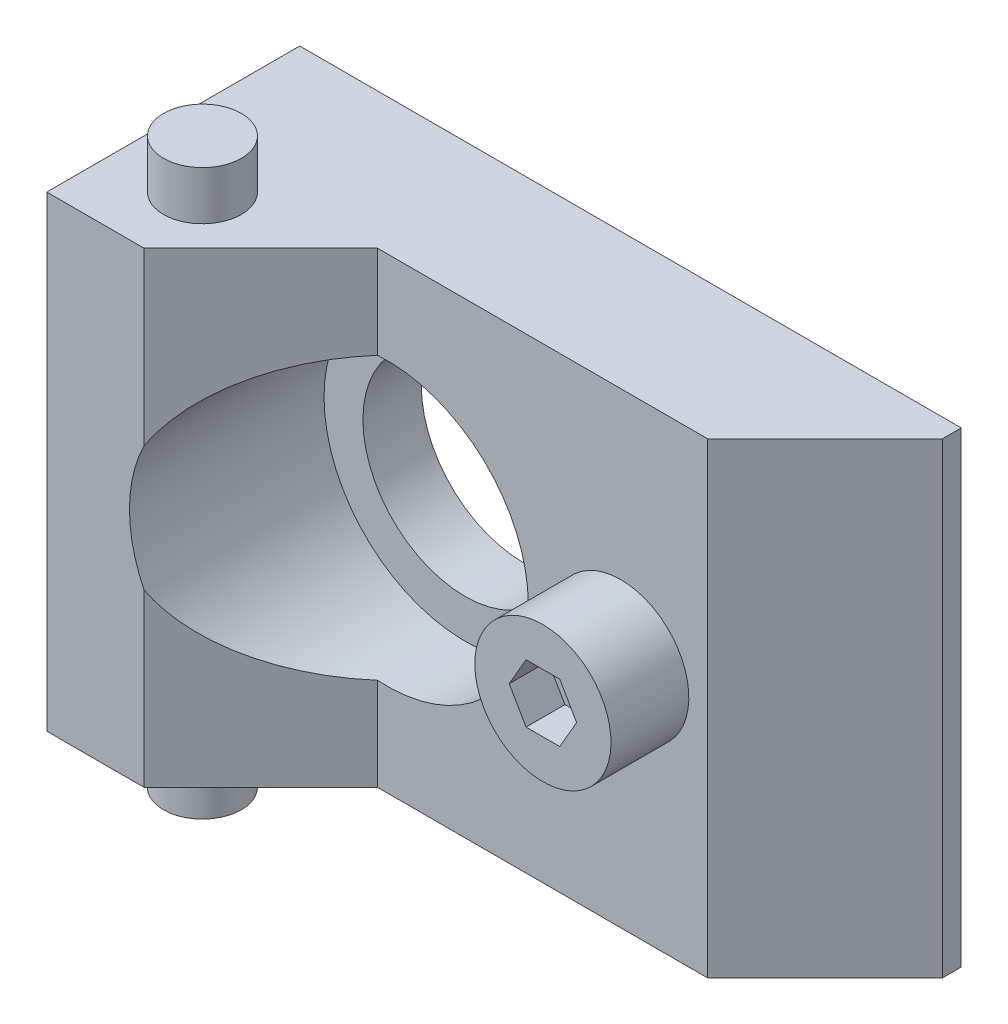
ISO-10303-21;
HEADER;
FILE_DESCRIPTION(('STEP AP214'),'2;1');
FILE_NAME('part.step','',(''),(''),'','','');
FILE_SCHEMA(('AUTOMOTIVE_DESIGN { 1 0 10303 214 1 1 1 1 }'));
ENDSEC;
DATA;
#1=APPLICATION_CONTEXT('core data for automotive mechanical design processes');
#2=APPLICATION_PROTOCOL_DEFINITION('international standard','automotive_design',2000,#1);
#3=PRODUCT_CONTEXT('',#1,'mechanical');
#4=PRODUCT('Part','Part','',(#3));
#5=PRODUCT_RELATED_PRODUCT_CATEGORY('part','',(#4));
#6=PRODUCT_DEFINITION_FORMATION('','',#4);
#7=PRODUCT_DEFINITION_CONTEXT('part definition',#1,'design');
#8=PRODUCT_DEFINITION('design','',#6,#7);
#9=PRODUCT_DEFINITION_SHAPE('','',#8);
#10=(LENGTH_UNIT() NAMED_UNIT(*) SI_UNIT(.MILLI.,.METRE.));
#11=(NAMED_UNIT(*) PLANE_ANGLE_UNIT() SI_UNIT($,.RADIAN.));
#12=(NAMED_UNIT(*) SI_UNIT($,.STERADIAN.) SOLID_ANGLE_UNIT());
#13=UNCERTAINTY_MEASURE_WITH_UNIT(LENGTH_MEASURE(1.E-05),#10,'distance_accuracy_value','');
#14=(GEOMETRIC_REPRESENTATION_CONTEXT(3) GLOBAL_UNCERTAINTY_ASSIGNED_CONTEXT((#13)) GLOBAL_UNIT_ASSIGNED_CONTEXT((#10,
#11,#12)) REPRESENTATION_CONTEXT('',''));
#15=CARTESIAN_POINT('',(0.,0.,0.));
#16=DIRECTION('',(0.,0.,1.));
#17=DIRECTION('',(1.,0.,0.));
#18=AXIS2_PLACEMENT_3D('',#15,#16,#17);
#19=CARTESIAN_POINT('',(0.,0.,-7.));
#20=DIRECTION('',(0.,0.,1.));
#21=DIRECTION('',(-0.898965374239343,-0.438019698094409,0.));
#22=AXIS2_PLACEMENT_3D('',#19,#20,#21);
#23=CYLINDRICAL_SURFACE('',#22,3.);
#24=CARTESIAN_POINT('',(0.,0.,-7.));
#25=DIRECTION('',(0.,0.,-1.));
#26=DIRECTION('',(0.898965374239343,0.438019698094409,0.));
#27=AXIS2_PLACEMENT_3D('',#24,#25,#26);
#28=CIRCLE('',#27,3.);
#29=CARTESIAN_POINT('',(2.69689612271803,1.31405909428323,-7.));
#30=VERTEX_POINT('',#29);
#31=EDGE_CURVE('E21',#30,#30,#28,.T.);
#32=ORIENTED_EDGE('',*,*,#31,.F.);
#33=EDGE_LOOP('',(#32));
#34=FACE_BOUND('',#33,.T.);
#35=CARTESIAN_POINT('',(0.,0.,0.));
#36=DIRECTION('',(0.,0.,1.));
#37=DIRECTION('',(0.,-1.,0.));
#38=AXIS2_PLACEMENT_3D('',#35,#36,#37);
#39=CIRCLE('',#38,3.);
#40=CARTESIAN_POINT('',(0.,-3.,0.));
#41=VERTEX_POINT('',#40);
#42=EDGE_CURVE('E9',#41,#41,#39,.T.);
#43=ORIENTED_EDGE('',*,*,#42,.F.);
#44=EDGE_LOOP('',(#43));
#45=FACE_BOUND('',#44,.T.);
#46=ADVANCED_FACE('F14',(#34,#45),#23,.T.);
#47=CARTESIAN_POINT('',(0.,0.,-7.));
#48=DIRECTION('',(0.,0.,-1.));
#49=DIRECTION('',(0.898965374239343,0.438019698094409,0.));
#50=AXIS2_PLACEMENT_3D('',#47,#48,#49);
#51=PLANE('',#50);
#52=ORIENTED_EDGE('',*,*,#31,.T.);
#53=EDGE_LOOP('',(#52));
#54=FACE_BOUND('',#53,.T.);
#55=ADVANCED_FACE('F224',(#54),#51,.T.);
#56=CARTESIAN_POINT('',(-0.866025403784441,1.5,9.));
#57=DIRECTION('',(0.,0.,1.));
#58=DIRECTION('',(0.,1.,0.));
#59=AXIS2_PLACEMENT_3D('',#56,#57,#58);
#60=PLANE('',#59);
#61=DIRECTION('',(0.5,0.86602540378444,0.));
#62=VECTOR('',#61,1.);
#63=CARTESIAN_POINT('',(-1.73205080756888,0.,9.));
#64=LINE('',#63,#62);
#65=CARTESIAN_POINT('',(-1.73205080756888,0.,9.));
#66=VERTEX_POINT('',#65);
#67=CARTESIAN_POINT('',(-0.866025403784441,1.5,9.));
#68=VERTEX_POINT('',#67);
#69=EDGE_CURVE('E175',#66,#68,#64,.T.);
#70=ORIENTED_EDGE('',*,*,#69,.F.);
#71=DIRECTION('',(0.5,-0.86602540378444,0.));
#72=VECTOR('',#71,1.);
#73=CARTESIAN_POINT('',(-1.73205080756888,0.,9.));
#74=LINE('',#73,#72);
#75=CARTESIAN_POINT('',(-0.866025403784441,-1.5,9.));
#76=VERTEX_POINT('',#75);
#77=EDGE_CURVE('E189',#66,#76,#74,.T.);
#78=ORIENTED_EDGE('',*,*,#77,.T.);
#79=DIRECTION('',(1.,0.,0.));
#80=VECTOR('',#79,1.);
#81=CARTESIAN_POINT('',(-0.866025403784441,-1.5,9.));
#82=LINE('',#81,#80);
#83=CARTESIAN_POINT('',(0.866025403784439,-1.5,9.));
#84=VERTEX_POINT('',#83);
#85=EDGE_CURVE('E192',#76,#84,#82,.T.);
#86=ORIENTED_EDGE('',*,*,#85,.T.);
#87=DIRECTION('',(-0.5,-0.86602540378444,0.));
#88=VECTOR('',#87,1.);
#89=CARTESIAN_POINT('',(1.73205080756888,0.,9.));
#90=LINE('',#89,#88);
#91=CARTESIAN_POINT('',(1.73205080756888,0.,9.));
#92=VERTEX_POINT('',#91);
#93=EDGE_CURVE('E195',#92,#84,#90,.T.);
#94=ORIENTED_EDGE('',*,*,#93,.F.);
#95=DIRECTION('',(-0.5,0.86602540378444,0.));
#96=VECTOR('',#95,1.);
#97=CARTESIAN_POINT('',(1.73205080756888,0.,9.));
#98=LINE('',#97,#96);
#99=CARTESIAN_POINT('',(0.866025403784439,1.5,9.));
#100=VERTEX_POINT('',#99);
#101=EDGE_CURVE('E198',#92,#100,#98,.T.);
#102=ORIENTED_EDGE('',*,*,#101,.T.);
#103=DIRECTION('',(-1.,0.,0.));
#104=VECTOR('',#103,1.);
#105=CARTESIAN_POINT('',(0.866025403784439,1.5,9.));
#106=LINE('',#105,#104);
#107=EDGE_CURVE('E201',#100,#68,#106,.T.);
#108=ORIENTED_EDGE('',*,*,#107,.T.);
#109=EDGE_LOOP('',(#70,#78,#86,#94,#102,#108));
#110=FACE_BOUND('',#109,.T.);
#111=ADVANCED_FACE('F244',(#110),#60,.T.);
#112=CARTESIAN_POINT('',(-0.866025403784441,-1.5,9.));
#113=DIRECTION('',(0.,-1.,0.));
#114=DIRECTION('',(1.,0.,0.));
#115=AXIS2_PLACEMENT_3D('',#112,#113,#114);
#116=PLANE('',#115);
#117=DIRECTION('',(0.,0.,1.));
#118=VECTOR('',#117,1.);
#119=CARTESIAN_POINT('',(-0.866025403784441,-1.5,9.));
#120=LINE('',#119,#118);
#121=CARTESIAN_POINT('',(-0.866025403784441,-1.5,11.));
#122=VERTEX_POINT('',#121);
#123=EDGE_CURVE('E206',#76,#122,#120,.T.);
#124=ORIENTED_EDGE('',*,*,#123,.T.);
#125=DIRECTION('',(1.,0.,0.));
#126=VECTOR('',#125,1.);
#127=CARTESIAN_POINT('',(-0.866025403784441,-1.5,11.));
#128=LINE('',#127,#126);
#129=CARTESIAN_POINT('',(0.866025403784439,-1.5,11.));
#130=VERTEX_POINT('',#129);
#131=EDGE_CURVE('E176',#122,#130,#128,.T.);
#132=ORIENTED_EDGE('',*,*,#131,.T.);
#133=DIRECTION('',(0.,0.,1.));
#134=VECTOR('',#133,1.);
#135=CARTESIAN_POINT('',(0.866025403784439,-1.5,9.));
#136=LINE('',#135,#134);
#137=EDGE_CURVE('E208',#84,#130,#136,.T.);
#138=ORIENTED_EDGE('',*,*,#137,.F.);
#139=ORIENTED_EDGE('',*,*,#85,.F.);
#140=EDGE_LOOP('',(#124,#132,#138,#139));
#141=FACE_BOUND('',#140,.T.);
#142=ADVANCED_FACE('F246',(#141),#116,.F.);
#143=CARTESIAN_POINT('',(1.73205080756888,0.,9.));
#144=DIRECTION('',(-0.86602540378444,0.5,0.));
#145=DIRECTION('',(-0.5,-0.86602540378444,0.));
#146=AXIS2_PLACEMENT_3D('',#143,#144,#145);
#147=PLANE('',#146);
#148=ORIENTED_EDGE('',*,*,#137,.T.);
#149=DIRECTION('',(-0.5,-0.86602540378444,0.));
#150=VECTOR('',#149,1.);
#151=CARTESIAN_POINT('',(1.73205080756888,0.,11.));
#152=LINE('',#151,#150);
#153=CARTESIAN_POINT('',(1.73205080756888,0.,11.));
#154=VERTEX_POINT('',#153);
#155=EDGE_CURVE('E179',#154,#130,#152,.T.);
#156=ORIENTED_EDGE('',*,*,#155,.F.);
#157=DIRECTION('',(0.,0.,1.));
#158=VECTOR('',#157,1.);
#159=CARTESIAN_POINT('',(1.73205080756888,0.,9.));
#160=LINE('',#159,#158);
#161=EDGE_CURVE('E210',#92,#154,#160,.T.);
#162=ORIENTED_EDGE('',*,*,#161,.F.);
#163=ORIENTED_EDGE('',*,*,#93,.T.);
#164=EDGE_LOOP('',(#148,#156,#162,#163));
#165=FACE_BOUND('',#164,.T.);
#166=ADVANCED_FACE('F254',(#165),#147,.T.);
#167=CARTESIAN_POINT('',(1.73205080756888,0.,9.));
#168=DIRECTION('',(0.86602540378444,0.5,0.));
#169=DIRECTION('',(-0.5,0.86602540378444,0.));
#170=AXIS2_PLACEMENT_3D('',#167,#168,#169);
#171=PLANE('',#170);
#172=ORIENTED_EDGE('',*,*,#161,.T.);
#173=DIRECTION('',(-0.5,0.86602540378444,0.));
#174=VECTOR('',#173,1.);
#175=CARTESIAN_POINT('',(1.73205080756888,0.,11.));
#176=LINE('',#175,#174);
#177=CARTESIAN_POINT('',(0.866025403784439,1.5,11.));
#178=VERTEX_POINT('',#177);
#179=EDGE_CURVE('E182',#154,#178,#176,.T.);
#180=ORIENTED_EDGE('',*,*,#179,.T.);
#181=DIRECTION('',(0.,0.,1.));
#182=VECTOR('',#181,1.);
#183=CARTESIAN_POINT('',(0.866025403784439,1.5,9.));
#184=LINE('',#183,#182);
#185=EDGE_CURVE('E212',#100,#178,#184,.T.);
#186=ORIENTED_EDGE('',*,*,#185,.F.);
#187=ORIENTED_EDGE('',*,*,#101,.F.);
#188=EDGE_LOOP('',(#172,#180,#186,#187));
#189=FACE_BOUND('',#188,.T.);
#190=ADVANCED_FACE('F270',(#189),#171,.F.);
#191=CARTESIAN_POINT('',(0.866025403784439,1.5,9.));
#192=DIRECTION('',(0.,1.,0.));
#193=DIRECTION('',(-1.,0.,0.));
#194=AXIS2_PLACEMENT_3D('',#191,#192,#193);
#195=PLANE('',#194);
#196=ORIENTED_EDGE('',*,*,#185,.T.);
#197=DIRECTION('',(-1.,0.,0.));
#198=VECTOR('',#197,1.);
#199=CARTESIAN_POINT('',(0.866025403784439,1.5,11.));
#200=LINE('',#199,#198);
#201=CARTESIAN_POINT('',(-0.866025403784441,1.5,11.));
#202=VERTEX_POINT('',#201);
#203=EDGE_CURVE('E185',#178,#202,#200,.T.);
#204=ORIENTED_EDGE('',*,*,#203,.T.);
#205=DIRECTION('',(0.,0.,1.));
#206=VECTOR('',#205,1.);
#207=CARTESIAN_POINT('',(-0.866025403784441,1.5,9.));
#208=LINE('',#207,#206);
#209=EDGE_CURVE('E214',#68,#202,#208,.T.);
#210=ORIENTED_EDGE('',*,*,#209,.F.);
#211=ORIENTED_EDGE('',*,*,#107,.F.);
#212=EDGE_LOOP('',(#196,#204,#210,#211));
#213=FACE_BOUND('',#212,.T.);
#214=ADVANCED_FACE('F263',(#213),#195,.F.);
#215=CARTESIAN_POINT('',(-1.73205080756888,0.,9.));
#216=DIRECTION('',(0.86602540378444,-0.5,0.));
#217=DIRECTION('',(0.5,0.86602540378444,0.));
#218=AXIS2_PLACEMENT_3D('',#215,#216,#217);
#219=PLANE('',#218);
#220=ORIENTED_EDGE('',*,*,#209,.T.);
#221=DIRECTION('',(0.5,0.86602540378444,0.));
#222=VECTOR('',#221,1.);
#223=CARTESIAN_POINT('',(-1.73205080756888,0.,11.));
#224=LINE('',#223,#222);
#225=CARTESIAN_POINT('',(-1.73205080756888,0.,11.));
#226=VERTEX_POINT('',#225);
#227=EDGE_CURVE('E28',#226,#202,#224,.T.);
#228=ORIENTED_EDGE('',*,*,#227,.F.);
#229=DIRECTION('',(0.,0.,1.));
#230=VECTOR('',#229,1.);
#231=CARTESIAN_POINT('',(-1.73205080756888,0.,9.));
#232=LINE('',#231,#230);
#233=EDGE_CURVE('E32',#66,#226,#232,.T.);
#234=ORIENTED_EDGE('',*,*,#233,.F.);
#235=ORIENTED_EDGE('',*,*,#69,.T.);
#236=EDGE_LOOP('',(#220,#228,#234,#235));
#237=FACE_BOUND('',#236,.T.);
#238=ADVANCED_FACE('F259',(#237),#219,.T.);
#239=CARTESIAN_POINT('',(-1.73205080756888,0.,9.));
#240=DIRECTION('',(-0.86602540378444,-0.5,0.));
#241=DIRECTION('',(0.5,-0.86602540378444,0.));
#242=AXIS2_PLACEMENT_3D('',#239,#240,#241);
#243=PLANE('',#242);
#244=ORIENTED_EDGE('',*,*,#77,.F.);
#245=ORIENTED_EDGE('',*,*,#233,.T.);
#246=DIRECTION('',(0.5,-0.86602540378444,0.));
#247=VECTOR('',#246,1.);
#248=CARTESIAN_POINT('',(-1.73205080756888,0.,11.));
#249=LINE('',#248,#247);
#250=EDGE_CURVE('E172',#226,#122,#249,.T.);
#251=ORIENTED_EDGE('',*,*,#250,.T.);
#252=ORIENTED_EDGE('',*,*,#123,.F.);
#253=EDGE_LOOP('',(#244,#245,#251,#252));
#254=FACE_BOUND('',#253,.T.);
#255=ADVANCED_FACE('F262',(#254),#243,.F.);
#256=CARTESIAN_POINT('',(0.,0.,11.));
#257=DIRECTION('',(0.,0.,1.));
#258=DIRECTION('',(0.,1.,0.));
#259=AXIS2_PLACEMENT_3D('',#256,#257,#258);
#260=PLANE('',#259);
#261=CARTESIAN_POINT('',(0.,0.,11.));
#262=DIRECTION('',(0.,0.,1.));
#263=DIRECTION('',(0.,1.,0.));
#264=AXIS2_PLACEMENT_3D('',#261,#262,#263);
#265=CIRCLE('',#264,3.5);
#266=CARTESIAN_POINT('',(0.,3.5,11.));
#267=VERTEX_POINT('',#266);
#268=EDGE_CURVE('E219',#267,#267,#265,.T.);
#269=ORIENTED_EDGE('',*,*,#268,.T.);
#270=EDGE_LOOP('',(#269));
#271=FACE_BOUND('',#270,.T.);
#272=ORIENTED_EDGE('',*,*,#250,.F.);
#273=ORIENTED_EDGE('',*,*,#227,.T.);
#274=ORIENTED_EDGE('',*,*,#203,.F.);
#275=ORIENTED_EDGE('',*,*,#179,.F.);
#276=ORIENTED_EDGE('',*,*,#155,.T.);
#277=ORIENTED_EDGE('',*,*,#131,.F.);
#278=EDGE_LOOP('',(#272,#273,#274,#275,#276,#277));
#279=FACE_BOUND('',#278,.T.);
#280=ADVANCED_FACE('F265',(#271,#279),#260,.T.);
#281=CARTESIAN_POINT('',(-19.5,14.5,9.));
#282=DIRECTION('',(0.,1.,0.));
#283=DIRECTION('',(-1.,0.,0.));
#284=AXIS2_PLACEMENT_3D('',#281,#282,#283);
#285=PLANE('',#284);
#286=CARTESIAN_POINT('',(-19.5,14.5,9.));
#287=DIRECTION('',(0.,1.,0.));
#288=DIRECTION('',(-1.,0.,0.));
#289=AXIS2_PLACEMENT_3D('',#286,#287,#288);
#290=CIRCLE('',#289,2.);
#291=CARTESIAN_POINT('',(-21.5,14.5,9.));
#292=VERTEX_POINT('',#291);
#293=EDGE_CURVE('E584',#292,#292,#290,.T.);
#294=ORIENTED_EDGE('',*,*,#293,.T.);
#295=EDGE_LOOP('',(#294));
#296=FACE_BOUND('',#295,.T.);
#297=ADVANCED_FACE('F285',(#296),#285,.T.);
#298=CARTESIAN_POINT('',(-19.5,-14.5,9.));
#299=DIRECTION('',(0.,-1.,0.));
#300=DIRECTION('',(-1.,0.,0.));
#301=AXIS2_PLACEMENT_3D('',#298,#299,#300);
#302=PLANE('',#301);
#303=CARTESIAN_POINT('',(-19.5,-14.5,9.));
#304=DIRECTION('',(0.,-1.,0.));
#305=DIRECTION('',(-1.,0.,0.));
#306=AXIS2_PLACEMENT_3D('',#303,#304,#305);
#307=CIRCLE('',#306,2.);
#308=CARTESIAN_POINT('',(-21.5,-14.5,9.));
#309=VERTEX_POINT('',#308);
#310=EDGE_CURVE('E141',#309,#309,#307,.T.);
#311=ORIENTED_EDGE('',*,*,#310,.T.);
#312=EDGE_LOOP('',(#311));
#313=FACE_BOUND('',#312,.T.);
#314=ADVANCED_FACE('F291',(#313),#302,.T.);
#315=CARTESIAN_POINT('',(-12.,0.,3.));
#316=DIRECTION('',(0.,0.,1.));
#317=DIRECTION('',(-1.,0.,0.));
#318=AXIS2_PLACEMENT_3D('',#315,#316,#317);
#319=CYLINDRICAL_SURFACE('',#318,7.25);
#320=CARTESIAN_POINT('',(-12.,0.,13.));
#321=DIRECTION('',(0.,0.,1.));
#322=DIRECTION('',(-1.,0.,0.));
#323=AXIS2_PLACEMENT_3D('',#320,#321,#322);
#324=CIRCLE('',#323,7.25);
#325=CARTESIAN_POINT('',(-18.5,3.21130814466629,13.));
#326=VERTEX_POINT('',#325);
#327=CARTESIAN_POINT('',(-18.5,-3.21130814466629,13.));
#328=VERTEX_POINT('',#327);
#329=EDGE_CURVE('E401',#326,#328,#324,.T.);
#330=ORIENTED_EDGE('',*,*,#329,.T.);
#331=CARTESIAN_POINT('',(-12.,0.,6.50000000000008));
#332=DIRECTION('',(-0.707106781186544,0.,-0.707106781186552));
#333=DIRECTION('',(-0.707106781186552,0.,0.707106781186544));
#334=AXIS2_PLACEMENT_3D('',#331,#332,#333);
#335=ELLIPSE('',#334,10.2530483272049,7.25);
#336=CARTESIAN_POINT('',(-12.5,-7.23273807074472,7.));
#337=VERTEX_POINT('',#336);
#338=EDGE_CURVE('E165',#328,#337,#335,.F.);
#339=ORIENTED_EDGE('',*,*,#338,.T.);
#340=CARTESIAN_POINT('',(-12.,0.,7.));
#341=DIRECTION('',(0.,0.,-1.));
#342=DIRECTION('',(1.,0.,0.));
#343=AXIS2_PLACEMENT_3D('',#340,#341,#342);
#344=CIRCLE('',#343,7.25);
#345=CARTESIAN_POINT('',(-12.5,7.23273807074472,7.));
#346=VERTEX_POINT('',#345);
#347=EDGE_CURVE('E147',#337,#346,#344,.F.);
#348=ORIENTED_EDGE('',*,*,#347,.T.);
#349=EDGE_CURVE('E151',#346,#326,#335,.F.);
#350=ORIENTED_EDGE('',*,*,#349,.T.);
#351=EDGE_LOOP('',(#330,#339,#348,#350));
#352=FACE_BOUND('',#351,.T.);
#353=CARTESIAN_POINT('',(-12.,0.,3.));
#354=DIRECTION('',(0.,0.,1.));
#355=DIRECTION('',(-1.,0.,0.));
#356=AXIS2_PLACEMENT_3D('',#353,#354,#355);
#357=CIRCLE('',#356,7.25);
#358=CARTESIAN_POINT('',(-19.25,0.,3.));
#359=VERTEX_POINT('',#358);
#360=EDGE_CURVE('E161',#359,#359,#357,.T.);
#361=ORIENTED_EDGE('',*,*,#360,.F.);
#362=EDGE_LOOP('',(#361));
#363=FACE_BOUND('',#362,.T.);
#364=ADVANCED_FACE('F282',(#352,#363),#319,.F.);
#365=CARTESIAN_POINT('',(0.,0.,19.));
#366=DIRECTION('',(0.,0.,1.));
#367=DIRECTION('',(0.,1.,0.));
#368=AXIS2_PLACEMENT_3D('',#365,#366,#367);
#369=CYLINDRICAL_SURFACE('',#368,3.5);
#370=CARTESIAN_POINT('',(0.,0.,7.));
#371=DIRECTION('',(0.,0.,1.));
#372=DIRECTION('',(0.,1.,0.));
#373=AXIS2_PLACEMENT_3D('',#370,#371,#372);
#374=CIRCLE('',#373,3.5);
#375=CARTESIAN_POINT('',(0.,3.5,7.));
#376=VERTEX_POINT('',#375);
#377=EDGE_CURVE('E216',#376,#376,#374,.T.);
#378=ORIENTED_EDGE('',*,*,#377,.T.);
#379=EDGE_LOOP('',(#378));
#380=FACE_BOUND('',#379,.T.);
#381=ORIENTED_EDGE('',*,*,#268,.F.);
#382=EDGE_LOOP('',(#381));
#383=FACE_BOUND('',#382,.T.);
#384=ADVANCED_FACE('F278',(#380,#383),#369,.T.);
#385=CARTESIAN_POINT('',(-12.,0.,3.));
#386=DIRECTION('',(0.,0.,1.));
#387=DIRECTION('',(-1.,0.,0.));
#388=AXIS2_PLACEMENT_3D('',#385,#386,#387);
#389=PLANE('',#388);
#390=ORIENTED_EDGE('',*,*,#360,.T.);
#391=EDGE_LOOP('',(#390));
#392=FACE_BOUND('',#391,.T.);
#393=CARTESIAN_POINT('',(-12.,0.,3.));
#394=DIRECTION('',(0.,0.,1.));
#395=DIRECTION('',(-1.,0.,0.));
#396=AXIS2_PLACEMENT_3D('',#393,#394,#395);
#397=CIRCLE('',#396,5.25);
#398=CARTESIAN_POINT('',(-17.25,0.,3.));
#399=VERTEX_POINT('',#398);
#400=EDGE_CURVE('E158',#399,#399,#397,.F.);
#401=ORIENTED_EDGE('',*,*,#400,.T.);
#402=EDGE_LOOP('',(#401));
#403=FACE_BOUND('',#402,.T.);
#404=ADVANCED_FACE('F281',(#392,#403),#389,.T.);
#405=CARTESIAN_POINT('',(-19.5,14.5,9.));
#406=DIRECTION('',(0.,-1.,0.));
#407=DIRECTION('',(1.,0.,0.));
#408=AXIS2_PLACEMENT_3D('',#405,#406,#407);
#409=CYLINDRICAL_SURFACE('',#408,2.);
#410=ORIENTED_EDGE('',*,*,#293,.F.);
#411=EDGE_LOOP('',(#410));
#412=FACE_BOUND('',#411,.T.);
#413=CARTESIAN_POINT('',(-19.5,12.,9.));
#414=DIRECTION('',(0.,-1.,0.));
#415=DIRECTION('',(1.,0.,0.));
#416=AXIS2_PLACEMENT_3D('',#413,#414,#415);
#417=CIRCLE('',#416,2.);
#418=CARTESIAN_POINT('',(-17.5,12.,9.));
#419=VERTEX_POINT('',#418);
#420=EDGE_CURVE('E169',#419,#419,#417,.F.);
#421=ORIENTED_EDGE('',*,*,#420,.T.);
#422=EDGE_LOOP('',(#421));
#423=FACE_BOUND('',#422,.T.);
#424=ADVANCED_FACE('F315',(#412,#423),#409,.T.);
#425=CARTESIAN_POINT('',(-18.5,-12.,13.));
#426=DIRECTION('',(-0.707106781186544,0.,-0.707106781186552));
#427=DIRECTION('',(0.707106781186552,0.,-0.707106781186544));
#428=AXIS2_PLACEMENT_3D('',#425,#426,#427);
#429=PLANE('',#428);
#430=DIRECTION('',(0.,1.,0.));
#431=VECTOR('',#430,1.);
#432=CARTESIAN_POINT('',(-12.5,-12.,7.));
#433=LINE('',#432,#431);
#434=CARTESIAN_POINT('',(-12.5,12.,7.));
#435=VERTEX_POINT('',#434);
#436=EDGE_CURVE('E405',#346,#435,#433,.T.);
#437=ORIENTED_EDGE('',*,*,#436,.T.);
#438=DIRECTION('',(-0.707106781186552,0.,0.707106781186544));
#439=VECTOR('',#438,1.);
#440=CARTESIAN_POINT('',(-18.5,12.,13.));
#441=LINE('',#440,#439);
#442=CARTESIAN_POINT('',(-18.5,12.,13.));
#443=VERTEX_POINT('',#442);
#444=EDGE_CURVE('E390',#435,#443,#441,.T.);
#445=ORIENTED_EDGE('',*,*,#444,.T.);
#446=DIRECTION('',(0.,1.,0.));
#447=VECTOR('',#446,1.);
#448=CARTESIAN_POINT('',(-18.5,-12.,13.));
#449=LINE('',#448,#447);
#450=EDGE_CURVE('E389',#326,#443,#449,.T.);
#451=ORIENTED_EDGE('',*,*,#450,.F.);
#452=ORIENTED_EDGE('',*,*,#349,.F.);
#453=EDGE_LOOP('',(#437,#445,#451,#452));
#454=FACE_BOUND('',#453,.T.);
#455=ADVANCED_FACE('F317',(#454),#429,.F.);
#456=CARTESIAN_POINT('',(-19.5,-14.5,9.));
#457=DIRECTION('',(0.,1.,0.));
#458=DIRECTION('',(1.,0.,0.));
#459=AXIS2_PLACEMENT_3D('',#456,#457,#458);
#460=CYLINDRICAL_SURFACE('',#459,2.);
#461=ORIENTED_EDGE('',*,*,#310,.F.);
#462=EDGE_LOOP('',(#461));
#463=FACE_BOUND('',#462,.T.);
#464=CARTESIAN_POINT('',(-19.5,-12.,9.));
#465=DIRECTION('',(0.,1.,0.));
#466=DIRECTION('',(0.,0.,1.));
#467=AXIS2_PLACEMENT_3D('',#464,#465,#466);
#468=CIRCLE('',#467,2.);
#469=CARTESIAN_POINT('',(-19.5,-12.,11.));
#470=VERTEX_POINT('',#469);
#471=EDGE_CURVE('E166',#470,#470,#468,.F.);
#472=ORIENTED_EDGE('',*,*,#471,.T.);
#473=EDGE_LOOP('',(#472));
#474=FACE_BOUND('',#473,.T.);
#475=ADVANCED_FACE('F320',(#463,#474),#460,.T.);
#476=CARTESIAN_POINT('',(10.5,12.,13.));
#477=DIRECTION('',(0.,0.,1.));
#478=DIRECTION('',(-1.,0.,0.));
#479=AXIS2_PLACEMENT_3D('',#476,#477,#478);
#480=PLANE('',#479);
#481=ORIENTED_EDGE('',*,*,#450,.T.);
#482=DIRECTION('',(-1.,0.,0.));
#483=VECTOR('',#482,1.);
#484=CARTESIAN_POINT('',(10.5,12.,13.));
#485=LINE('',#484,#483);
#486=CARTESIAN_POINT('',(-23.5,12.,13.));
#487=VERTEX_POINT('',#486);
#488=EDGE_CURVE('E365',#443,#487,#485,.T.);
#489=ORIENTED_EDGE('',*,*,#488,.T.);
#490=DIRECTION('',(0.,-1.,0.));
#491=VECTOR('',#490,1.);
#492=CARTESIAN_POINT('',(-23.5,-12.,13.));
#493=LINE('',#492,#491);
#494=CARTESIAN_POINT('',(-23.5,-12.,13.));
#495=VERTEX_POINT('',#494);
#496=EDGE_CURVE('E367',#487,#495,#493,.T.);
#497=ORIENTED_EDGE('',*,*,#496,.T.);
#498=DIRECTION('',(1.,0.,0.));
#499=VECTOR('',#498,1.);
#500=CARTESIAN_POINT('',(10.5,-12.,13.));
#501=LINE('',#500,#499);
#502=CARTESIAN_POINT('',(-18.5,-12.,13.));
#503=VERTEX_POINT('',#502);
#504=EDGE_CURVE('E369',#495,#503,#501,.T.);
#505=ORIENTED_EDGE('',*,*,#504,.T.);
#506=EDGE_CURVE('E399',#503,#328,#449,.T.);
#507=ORIENTED_EDGE('',*,*,#506,.T.);
#508=ORIENTED_EDGE('',*,*,#329,.F.);
#509=EDGE_LOOP('',(#481,#489,#497,#505,#507,#508));
#510=FACE_BOUND('',#509,.T.);
#511=ADVANCED_FACE('F323',(#510),#480,.T.);
#512=ORIENTED_EDGE('',*,*,#506,.F.);
#513=DIRECTION('',(-0.707106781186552,0.,0.707106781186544));
#514=VECTOR('',#513,1.);
#515=CARTESIAN_POINT('',(-18.5,-12.,13.));
#516=LINE('',#515,#514);
#517=CARTESIAN_POINT('',(-12.5,-12.,7.));
#518=VERTEX_POINT('',#517);
#519=EDGE_CURVE('E130',#518,#503,#516,.T.);
#520=ORIENTED_EDGE('',*,*,#519,.F.);
#521=EDGE_CURVE('E402',#518,#337,#433,.T.);
#522=ORIENTED_EDGE('',*,*,#521,.T.);
#523=ORIENTED_EDGE('',*,*,#338,.F.);
#524=EDGE_LOOP('',(#512,#520,#522,#523));
#525=FACE_BOUND('',#524,.T.);
#526=ADVANCED_FACE('F325',(#525),#429,.F.);
#527=CARTESIAN_POINT('',(4.4705627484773,-12.,7.));
#528=DIRECTION('',(0.,0.,-1.));
#529=DIRECTION('',(1.,0.,0.));
#530=AXIS2_PLACEMENT_3D('',#527,#528,#529);
#531=PLANE('',#530);
#532=ORIENTED_EDGE('',*,*,#377,.F.);
#533=EDGE_LOOP('',(#532));
#534=FACE_BOUND('',#533,.T.);
#535=ORIENTED_EDGE('',*,*,#521,.F.);
#536=DIRECTION('',(-1.,0.,0.));
#537=VECTOR('',#536,1.);
#538=CARTESIAN_POINT('',(4.4705627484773,-12.,7.));
#539=LINE('',#538,#537);
#540=CARTESIAN_POINT('',(4.4705627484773,-12.,7.));
#541=VERTEX_POINT('',#540);
#542=EDGE_CURVE('E393',#541,#518,#539,.T.);
#543=ORIENTED_EDGE('',*,*,#542,.F.);
#544=DIRECTION('',(0.,1.,0.));
#545=VECTOR('',#544,1.);
#546=CARTESIAN_POINT('',(4.4705627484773,-12.,7.));
#547=LINE('',#546,#545);
#548=CARTESIAN_POINT('',(4.4705627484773,12.,7.));
#549=VERTEX_POINT('',#548);
#550=EDGE_CURVE('E129',#541,#549,#547,.T.);
#551=ORIENTED_EDGE('',*,*,#550,.T.);
#552=DIRECTION('',(-1.,0.,0.));
#553=VECTOR('',#552,1.);
#554=CARTESIAN_POINT('',(4.4705627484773,12.,7.));
#555=LINE('',#554,#553);
#556=EDGE_CURVE('E140',#549,#435,#555,.T.);
#557=ORIENTED_EDGE('',*,*,#556,.T.);
#558=ORIENTED_EDGE('',*,*,#436,.F.);
#559=ORIENTED_EDGE('',*,*,#347,.F.);
#560=EDGE_LOOP('',(#535,#543,#551,#557,#558,#559));
#561=FACE_BOUND('',#560,.T.);
#562=ADVANCED_FACE('F328',(#534,#561),#531,.F.);
#563=CARTESIAN_POINT('',(4.4705627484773,-12.,7.));
#564=DIRECTION('',(-0.707106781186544,0.,-0.707106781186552));
#565=DIRECTION('',(0.707106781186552,0.,-0.707106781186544));
#566=AXIS2_PLACEMENT_3D('',#563,#564,#565);
#567=PLANE('',#566);
#568=DIRECTION('',(-0.707106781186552,0.,0.707106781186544));
#569=VECTOR('',#568,1.);
#570=CARTESIAN_POINT('',(4.4705627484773,12.,7.));
#571=LINE('',#570,#569);
#572=CARTESIAN_POINT('',(10.5,12.,0.970562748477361));
#573=VERTEX_POINT('',#572);
#574=EDGE_CURVE('E122',#573,#549,#571,.T.);
#575=ORIENTED_EDGE('',*,*,#574,.T.);
#576=ORIENTED_EDGE('',*,*,#550,.F.);
#577=DIRECTION('',(-0.707106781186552,0.,0.707106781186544));
#578=VECTOR('',#577,1.);
#579=CARTESIAN_POINT('',(4.4705627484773,-12.,7.));
#580=LINE('',#579,#578);
#581=CARTESIAN_POINT('',(10.5,-12.,0.970562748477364));
#582=VERTEX_POINT('',#581);
#583=EDGE_CURVE('E125',#582,#541,#580,.T.);
#584=ORIENTED_EDGE('',*,*,#583,.F.);
#585=DIRECTION('',(0.,1.,0.));
#586=VECTOR('',#585,1.);
#587=CARTESIAN_POINT('',(10.5,-12.,0.970562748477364));
#588=LINE('',#587,#586);
#589=EDGE_CURVE('E119',#582,#573,#588,.T.);
#590=ORIENTED_EDGE('',*,*,#589,.T.);
#591=EDGE_LOOP('',(#575,#576,#584,#590));
#592=FACE_BOUND('',#591,.T.);
#593=ADVANCED_FACE('F121',(#592),#567,.F.);
#594=CARTESIAN_POINT('',(-12.,0.,13.));
#595=DIRECTION('',(0.,0.,1.));
#596=DIRECTION('',(-1.,0.,0.));
#597=AXIS2_PLACEMENT_3D('',#594,#595,#596);
#598=CYLINDRICAL_SURFACE('',#597,5.25);
#599=CARTESIAN_POINT('',(-12.,0.,0.));
#600=DIRECTION('',(0.,0.,1.));
#601=DIRECTION('',(-1.,0.,0.));
#602=AXIS2_PLACEMENT_3D('',#599,#600,#601);
#603=CIRCLE('',#602,5.25);
#604=CARTESIAN_POINT('',(-17.25,0.,0.));
#605=VERTEX_POINT('',#604);
#606=EDGE_CURVE('E160',#605,#605,#603,.T.);
#607=ORIENTED_EDGE('',*,*,#606,.F.);
#608=EDGE_LOOP('',(#607));
#609=FACE_BOUND('',#608,.T.);
#610=ORIENTED_EDGE('',*,*,#400,.F.);
#611=EDGE_LOOP('',(#610));
#612=FACE_BOUND('',#611,.T.);
#613=ADVANCED_FACE('F335',(#609,#612),#598,.F.);
#614=CARTESIAN_POINT('',(10.5,12.,13.));
#615=DIRECTION('',(0.,-1.,0.));
#616=DIRECTION('',(1.,0.,0.));
#617=AXIS2_PLACEMENT_3D('',#614,#615,#616);
#618=PLANE('',#617);
#619=ORIENTED_EDGE('',*,*,#488,.F.);
#620=ORIENTED_EDGE('',*,*,#444,.F.);
#621=ORIENTED_EDGE('',*,*,#556,.F.);
#622=ORIENTED_EDGE('',*,*,#574,.F.);
#623=DIRECTION('',(0.,0.,-1.));
#624=VECTOR('',#623,1.);
#625=CARTESIAN_POINT('',(10.5,12.,13.));
#626=LINE('',#625,#624);
#627=CARTESIAN_POINT('',(10.5,12.,0.));
#628=VERTEX_POINT('',#627);
#629=EDGE_CURVE('E136',#573,#628,#626,.T.);
#630=ORIENTED_EDGE('',*,*,#629,.T.);
#631=DIRECTION('',(-1.,0.,0.));
#632=VECTOR('',#631,1.);
#633=CARTESIAN_POINT('',(10.5,12.,0.));
#634=LINE('',#633,#632);
#635=CARTESIAN_POINT('',(-23.5,12.,0.));
#636=VERTEX_POINT('',#635);
#637=EDGE_CURVE('E354',#628,#636,#634,.T.);
#638=ORIENTED_EDGE('',*,*,#637,.T.);
#639=DIRECTION('',(0.,0.,-1.));
#640=VECTOR('',#639,1.);
#641=CARTESIAN_POINT('',(-23.5,12.,13.));
#642=LINE('',#641,#640);
#643=EDGE_CURVE('E148',#487,#636,#642,.T.);
#644=ORIENTED_EDGE('',*,*,#643,.F.);
#645=EDGE_LOOP('',(#619,#620,#621,#622,#630,#638,#644));
#646=FACE_BOUND('',#645,.T.);
#647=ORIENTED_EDGE('',*,*,#420,.F.);
#648=EDGE_LOOP('',(#647));
#649=FACE_BOUND('',#648,.T.);
#650=ADVANCED_FACE('F134',(#646,#649),#618,.F.);
#651=CARTESIAN_POINT('',(-23.5,-12.,13.));
#652=DIRECTION('',(1.,0.,0.));
#653=DIRECTION('',(0.,0.,1.));
#654=AXIS2_PLACEMENT_3D('',#651,#652,#653);
#655=PLANE('',#654);
#656=DIRECTION('',(0.,-1.,0.));
#657=VECTOR('',#656,1.);
#658=CARTESIAN_POINT('',(-23.5,-12.,0.));
#659=LINE('',#658,#657);
#660=CARTESIAN_POINT('',(-23.5,-12.,0.));
#661=VERTEX_POINT('',#660);
#662=EDGE_CURVE('E360',#636,#661,#659,.T.);
#663=ORIENTED_EDGE('',*,*,#662,.T.);
#664=DIRECTION('',(0.,0.,-1.));
#665=VECTOR('',#664,1.);
#666=CARTESIAN_POINT('',(-23.5,-12.,13.));
#667=LINE('',#666,#665);
#668=EDGE_CURVE('E154',#495,#661,#667,.T.);
#669=ORIENTED_EDGE('',*,*,#668,.F.);
#670=ORIENTED_EDGE('',*,*,#496,.F.);
#671=ORIENTED_EDGE('',*,*,#643,.T.);
#672=EDGE_LOOP('',(#663,#669,#670,#671));
#673=FACE_BOUND('',#672,.T.);
#674=ADVANCED_FACE('F347',(#673),#655,.F.);
#675=CARTESIAN_POINT('',(10.5,-12.,13.));
#676=DIRECTION('',(0.,1.,0.));
#677=DIRECTION('',(-1.,0.,0.));
#678=AXIS2_PLACEMENT_3D('',#675,#676,#677);
#679=PLANE('',#678);
#680=ORIENTED_EDGE('',*,*,#542,.T.);
#681=ORIENTED_EDGE('',*,*,#519,.T.);
#682=ORIENTED_EDGE('',*,*,#504,.F.);
#683=ORIENTED_EDGE('',*,*,#668,.T.);
#684=DIRECTION('',(1.,0.,0.));
#685=VECTOR('',#684,1.);
#686=CARTESIAN_POINT('',(10.5,-12.,0.));
#687=LINE('',#686,#685);
#688=CARTESIAN_POINT('',(10.5,-12.,0.));
#689=VERTEX_POINT('',#688);
#690=EDGE_CURVE('E362',#661,#689,#687,.T.);
#691=ORIENTED_EDGE('',*,*,#690,.T.);
#692=DIRECTION('',(0.,0.,-1.));
#693=VECTOR('',#692,1.);
#694=CARTESIAN_POINT('',(10.5,-12.,13.));
#695=LINE('',#694,#693);
#696=EDGE_CURVE('E372',#582,#689,#695,.T.);
#697=ORIENTED_EDGE('',*,*,#696,.F.);
#698=ORIENTED_EDGE('',*,*,#583,.T.);
#699=EDGE_LOOP('',(#680,#681,#682,#683,#691,#697,#698));
#700=FACE_BOUND('',#699,.T.);
#701=ORIENTED_EDGE('',*,*,#471,.F.);
#702=EDGE_LOOP('',(#701));
#703=FACE_BOUND('',#702,.T.);
#704=ADVANCED_FACE('F239',(#700,#703),#679,.F.);
#705=CARTESIAN_POINT('',(10.5,-12.,13.));
#706=DIRECTION('',(-1.,0.,0.));
#707=DIRECTION('',(0.,0.,-1.));
#708=AXIS2_PLACEMENT_3D('',#705,#706,#707);
#709=PLANE('',#708);
#710=ORIENTED_EDGE('',*,*,#629,.F.);
#711=ORIENTED_EDGE('',*,*,#589,.F.);
#712=ORIENTED_EDGE('',*,*,#696,.T.);
#713=DIRECTION('',(0.,1.,0.));
#714=VECTOR('',#713,1.);
#715=CARTESIAN_POINT('',(10.5,-12.,0.));
#716=LINE('',#715,#714);
#717=EDGE_CURVE('E146',#689,#628,#716,.T.);
#718=ORIENTED_EDGE('',*,*,#717,.T.);
#719=EDGE_LOOP('',(#710,#711,#712,#718));
#720=FACE_BOUND('',#719,.T.);
#721=ADVANCED_FACE('F144',(#720),#709,.F.);
#722=CARTESIAN_POINT('',(10.5,12.,0.));
#723=DIRECTION('',(0.,0.,1.));
#724=DIRECTION('',(-1.,0.,0.));
#725=AXIS2_PLACEMENT_3D('',#722,#723,#724);
#726=PLANE('',#725);
#727=ORIENTED_EDGE('',*,*,#717,.F.);
#728=ORIENTED_EDGE('',*,*,#690,.F.);
#729=ORIENTED_EDGE('',*,*,#662,.F.);
#730=ORIENTED_EDGE('',*,*,#637,.F.);
#731=EDGE_LOOP('',(#727,#728,#729,#730));
#732=FACE_BOUND('',#731,.T.);
#733=ORIENTED_EDGE('',*,*,#606,.T.);
#734=EDGE_LOOP('',(#733));
#735=FACE_BOUND('',#734,.T.);
#736=ORIENTED_EDGE('',*,*,#42,.T.);
#737=EDGE_LOOP('',(#736));
#738=FACE_BOUND('',#737,.T.);
#739=ADVANCED_FACE('F228',(#732,#735,#738),#726,.F.);
#740=CLOSED_SHELL('',(#46,#55,#111,#142,#166,#190,#214,#238,#255,#280,#297,#314,#364,#384,#404,
#424,#455,#475,#511,#526,#562,#593,#613,#650,#674,#704,#721,#739));
#741=MANIFOLD_SOLID_BREP('B1',#740);
#742=ADVANCED_BREP_SHAPE_REPRESENTATION('',(#18,#741),#14);
#743=SHAPE_DEFINITION_REPRESENTATION(#9,#742);
ENDSEC;
END-ISO-10303-21;
